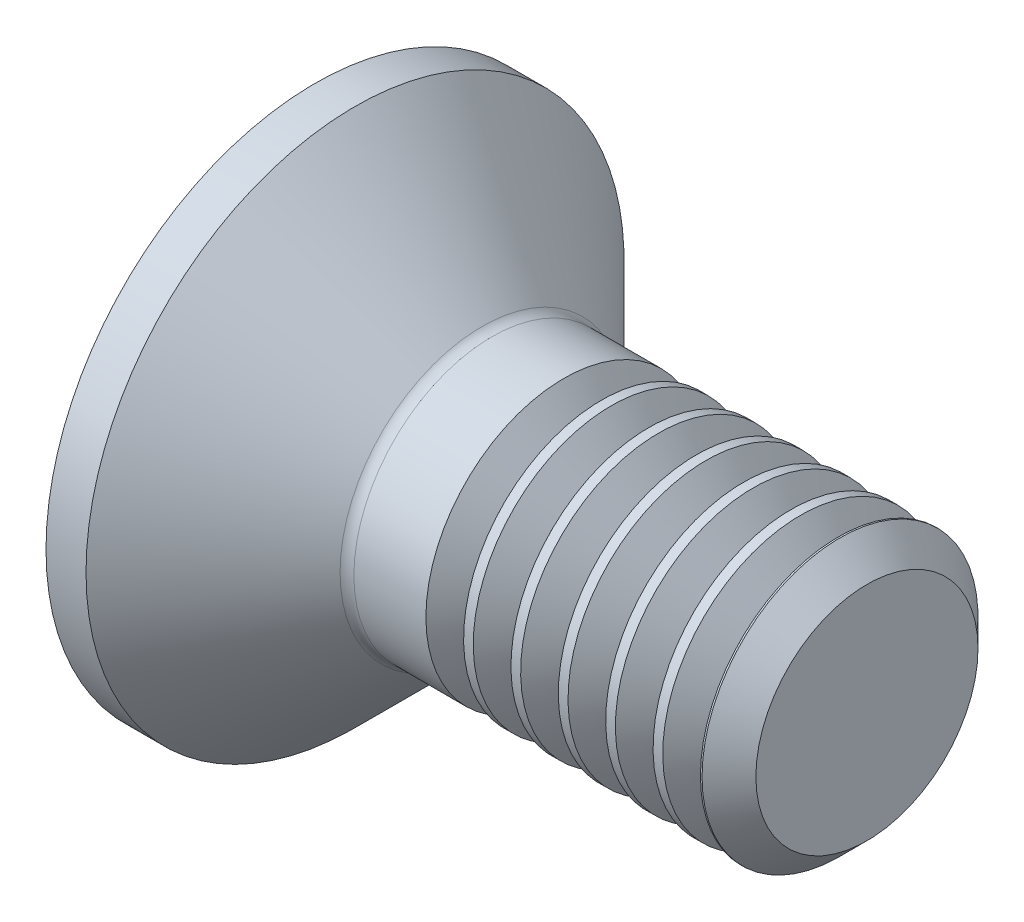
ISO-10303-21;
HEADER;
FILE_DESCRIPTION(('STEP AP214'),'2;1');
FILE_NAME('part.step','',(''),(''),'','','');
FILE_SCHEMA(('AUTOMOTIVE_DESIGN { 1 0 10303 214 1 1 1 1 }'));
ENDSEC;
DATA;
#1=APPLICATION_CONTEXT('core data for automotive mechanical design processes');
#2=APPLICATION_PROTOCOL_DEFINITION('international standard','automotive_design',2000,#1);
#3=PRODUCT_CONTEXT('',#1,'mechanical');
#4=PRODUCT('Part','Part','',(#3));
#5=PRODUCT_RELATED_PRODUCT_CATEGORY('part','',(#4));
#6=PRODUCT_DEFINITION_FORMATION('','',#4);
#7=PRODUCT_DEFINITION_CONTEXT('part definition',#1,'design');
#8=PRODUCT_DEFINITION('design','',#6,#7);
#9=PRODUCT_DEFINITION_SHAPE('','',#8);
#10=(LENGTH_UNIT() NAMED_UNIT(*) SI_UNIT(.MILLI.,.METRE.));
#11=(NAMED_UNIT(*) PLANE_ANGLE_UNIT() SI_UNIT($,.RADIAN.));
#12=(NAMED_UNIT(*) SI_UNIT($,.STERADIAN.) SOLID_ANGLE_UNIT());
#13=UNCERTAINTY_MEASURE_WITH_UNIT(LENGTH_MEASURE(1.E-05),#10,'distance_accuracy_value','');
#14=(GEOMETRIC_REPRESENTATION_CONTEXT(3) GLOBAL_UNCERTAINTY_ASSIGNED_CONTEXT((#13)) GLOBAL_UNIT_ASSIGNED_CONTEXT((#10,
#11,#12)) REPRESENTATION_CONTEXT('',''));
#15=CARTESIAN_POINT('',(0.,0.,0.));
#16=DIRECTION('',(0.,0.,1.));
#17=DIRECTION('',(1.,0.,0.));
#18=AXIS2_PLACEMENT_3D('',#15,#16,#17);
#19=CARTESIAN_POINT('',(0.,0.,0.));
#20=DIRECTION('',(-1.,0.,0.));
#21=DIRECTION('',(0.,0.,1.));
#22=AXIS2_PLACEMENT_3D('',#19,#20,#21);
#23=PLANE('',#22);
#24=CARTESIAN_POINT('',(0.,0.,0.));
#25=DIRECTION('',(-1.,0.,0.));
#26=DIRECTION('',(0.,0.,1.));
#27=AXIS2_PLACEMENT_3D('',#24,#25,#26);
#28=CIRCLE('',#27,3.9);
#29=CARTESIAN_POINT('',(0.,0.,3.9));
#30=VERTEX_POINT('',#29);
#31=EDGE_CURVE('E158',#30,#30,#28,.T.);
#32=ORIENTED_EDGE('',*,*,#31,.T.);
#33=EDGE_LOOP('',(#32));
#34=FACE_BOUND('',#33,.T.);
#35=DIRECTION('',(0.,-0.5,-0.866025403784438));
#36=VECTOR('',#35,1.);
#37=CARTESIAN_POINT('',(0.,-0.721687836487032,1.25));
#38=LINE('',#37,#36);
#39=CARTESIAN_POINT('',(0.,-0.721687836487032,1.25));
#40=VERTEX_POINT('',#39);
#41=CARTESIAN_POINT('',(0.,-1.44337567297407,0.));
#42=VERTEX_POINT('',#41);
#43=EDGE_CURVE('E120',#40,#42,#38,.T.);
#44=ORIENTED_EDGE('',*,*,#43,.T.);
#45=DIRECTION('',(0.,0.5,-0.866025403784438));
#46=VECTOR('',#45,1.);
#47=CARTESIAN_POINT('',(0.,-1.44337567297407,0.));
#48=LINE('',#47,#46);
#49=CARTESIAN_POINT('',(0.,-0.721687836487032,-1.25));
#50=VERTEX_POINT('',#49);
#51=EDGE_CURVE('E50',#42,#50,#48,.T.);
#52=ORIENTED_EDGE('',*,*,#51,.T.);
#53=DIRECTION('',(0.,1.,0.));
#54=VECTOR('',#53,1.);
#55=CARTESIAN_POINT('',(0.,-0.721687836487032,-1.25));
#56=LINE('',#55,#54);
#57=CARTESIAN_POINT('',(0.,0.721687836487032,-1.25));
#58=VERTEX_POINT('',#57);
#59=EDGE_CURVE('E135',#50,#58,#56,.T.);
#60=ORIENTED_EDGE('',*,*,#59,.T.);
#61=DIRECTION('',(0.,0.5,0.866025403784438));
#62=VECTOR('',#61,1.);
#63=CARTESIAN_POINT('',(0.,0.721687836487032,-1.25));
#64=LINE('',#63,#62);
#65=CARTESIAN_POINT('',(0.,1.44337567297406,0.));
#66=VERTEX_POINT('',#65);
#67=EDGE_CURVE('E353',#58,#66,#64,.T.);
#68=ORIENTED_EDGE('',*,*,#67,.T.);
#69=DIRECTION('',(0.,-0.5,0.866025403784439));
#70=VECTOR('',#69,1.);
#71=CARTESIAN_POINT('',(0.,1.44337567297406,0.));
#72=LINE('',#71,#70);
#73=CARTESIAN_POINT('',(0.,0.721687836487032,1.25));
#74=VERTEX_POINT('',#73);
#75=EDGE_CURVE('E356',#66,#74,#72,.T.);
#76=ORIENTED_EDGE('',*,*,#75,.T.);
#77=DIRECTION('',(0.,-1.,0.));
#78=VECTOR('',#77,1.);
#79=CARTESIAN_POINT('',(0.,0.721687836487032,1.25));
#80=LINE('',#79,#78);
#81=EDGE_CURVE('E359',#74,#40,#80,.T.);
#82=ORIENTED_EDGE('',*,*,#81,.T.);
#83=EDGE_LOOP('',(#44,#52,#60,#68,#76,#82));
#84=FACE_BOUND('',#83,.T.);
#85=ADVANCED_FACE('F35',(#34,#84),#23,.T.);
#86=CARTESIAN_POINT('',(0.,0.,0.));
#87=DIRECTION('',(-1.,0.,0.));
#88=DIRECTION('',(0.,0.,1.));
#89=AXIS2_PLACEMENT_3D('',#86,#87,#88);
#90=CYLINDRICAL_SURFACE('',#89,3.9);
#91=CARTESIAN_POINT('',(0.580000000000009,0.,0.));
#92=DIRECTION('',(-1.,0.,0.));
#93=DIRECTION('',(0.,0.,1.));
#94=AXIS2_PLACEMENT_3D('',#91,#92,#93);
#95=CIRCLE('',#94,3.9);
#96=CARTESIAN_POINT('',(0.580000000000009,0.,3.9));
#97=VERTEX_POINT('',#96);
#98=EDGE_CURVE('E155',#97,#97,#95,.T.);
#99=ORIENTED_EDGE('',*,*,#98,.T.);
#100=EDGE_LOOP('',(#99));
#101=FACE_BOUND('',#100,.T.);
#102=ORIENTED_EDGE('',*,*,#31,.F.);
#103=EDGE_LOOP('',(#102));
#104=FACE_BOUND('',#103,.T.);
#105=ADVANCED_FACE('F180',(#101,#104),#90,.T.);
#106=CARTESIAN_POINT('',(0.580000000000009,0.,0.));
#107=DIRECTION('',(-1.,0.,0.));
#108=DIRECTION('',(0.,0.,1.));
#109=AXIS2_PLACEMENT_3D('',#106,#107,#108);
#110=CONICAL_SURFACE('',#109,3.9,0.78539816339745);
#111=CARTESIAN_POINT('',(2.42142135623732,0.,0.));
#112=DIRECTION('',(-1.,0.,0.));
#113=DIRECTION('',(0.,0.,1.));
#114=AXIS2_PLACEMENT_3D('',#111,#112,#113);
#115=CIRCLE('',#114,2.05857864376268);
#116=CARTESIAN_POINT('',(2.42142135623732,0.,2.05857864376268));
#117=VERTEX_POINT('',#116);
#118=EDGE_CURVE('E43',#117,#117,#115,.T.);
#119=ORIENTED_EDGE('',*,*,#118,.T.);
#120=EDGE_LOOP('',(#119));
#121=FACE_BOUND('',#120,.T.);
#122=ORIENTED_EDGE('',*,*,#98,.F.);
#123=EDGE_LOOP('',(#122));
#124=FACE_BOUND('',#123,.T.);
#125=ADVANCED_FACE('F163',(#121,#124),#110,.T.);
#126=CARTESIAN_POINT('',(0.,0.,0.));
#127=DIRECTION('',(-1.,0.,0.));
#128=DIRECTION('',(0.,0.,1.));
#129=AXIS2_PLACEMENT_3D('',#126,#127,#128);
#130=CYLINDRICAL_SURFACE('',#129,1.99999999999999);
#131=CARTESIAN_POINT('',(3.60692006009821,0.,0.));
#132=DIRECTION('',(-1.,0.,0.));
#133=DIRECTION('',(0.,-1.,0.));
#134=AXIS2_PLACEMENT_3D('',#131,#132,#133);
#135=CIRCLE('',#134,2.);
#136=CARTESIAN_POINT('',(3.60692006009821,-2.,0.));
#137=VERTEX_POINT('',#136);
#138=EDGE_CURVE('E331',#137,#137,#135,.T.);
#139=ORIENTED_EDGE('',*,*,#138,.T.);
#140=EDGE_LOOP('',(#139));
#141=FACE_BOUND('',#140,.T.);
#142=CARTESIAN_POINT('',(2.56284271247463,0.,0.));
#143=DIRECTION('',(-1.,0.,0.));
#144=DIRECTION('',(0.,0.,1.));
#145=AXIS2_PLACEMENT_3D('',#142,#143,#144);
#146=CIRCLE('',#145,1.99999999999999);
#147=CARTESIAN_POINT('',(2.56284271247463,0.,1.99999999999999));
#148=VERTEX_POINT('',#147);
#149=EDGE_CURVE('E11',#148,#148,#146,.F.);
#150=ORIENTED_EDGE('',*,*,#149,.T.);
#151=EDGE_LOOP('',(#150));
#152=FACE_BOUND('',#151,.T.);
#153=ADVANCED_FACE('F167',(#141,#152),#130,.T.);
#154=CARTESIAN_POINT('',(2.56284271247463,0.,0.));
#155=DIRECTION('',(-1.,0.,0.));
#156=DIRECTION('',(0.,0.,1.));
#157=AXIS2_PLACEMENT_3D('',#154,#155,#156);
#158=TOROIDAL_SURFACE('',#157,2.19999999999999,0.2);
#159=ORIENTED_EDGE('',*,*,#149,.F.);
#160=EDGE_LOOP('',(#159));
#161=FACE_BOUND('',#160,.T.);
#162=ORIENTED_EDGE('',*,*,#118,.F.);
#163=EDGE_LOOP('',(#162));
#164=FACE_BOUND('',#163,.T.);
#165=ADVANCED_FACE('F37',(#161,#164),#158,.F.);
#166=CARTESIAN_POINT('',(1.5,-1.44337567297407,0.));
#167=DIRECTION('',(0.,0.866025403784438,0.5));
#168=DIRECTION('',(0.,-0.5,0.866025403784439));
#169=AXIS2_PLACEMENT_3D('',#166,#167,#168);
#170=PLANE('',#169);
#171=ORIENTED_EDGE('',*,*,#51,.F.);
#172=DIRECTION('',(-1.,0.,0.));
#173=VECTOR('',#172,1.);
#174=CARTESIAN_POINT('',(1.5,-1.44337567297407,0.));
#175=LINE('',#174,#173);
#176=CARTESIAN_POINT('',(1.5,-1.44337567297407,0.));
#177=VERTEX_POINT('',#176);
#178=EDGE_CURVE('E350',#177,#42,#175,.T.);
#179=ORIENTED_EDGE('',*,*,#178,.F.);
#180=DIRECTION('',(0.,0.5,-0.866025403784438));
#181=VECTOR('',#180,1.);
#182=CARTESIAN_POINT('',(1.5,-1.44337567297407,0.));
#183=LINE('',#182,#181);
#184=CARTESIAN_POINT('',(1.5,-1.08253175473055,-0.625000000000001));
#185=VERTEX_POINT('',#184);
#186=EDGE_CURVE('E117',#177,#185,#183,.T.);
#187=ORIENTED_EDGE('',*,*,#186,.T.);
#188=CARTESIAN_POINT('',(1.5,-0.721687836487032,-1.25));
#189=VERTEX_POINT('',#188);
#190=EDGE_CURVE('E111',#185,#189,#183,.T.);
#191=ORIENTED_EDGE('',*,*,#190,.T.);
#192=DIRECTION('',(-1.,0.,0.));
#193=VECTOR('',#192,1.);
#194=CARTESIAN_POINT('',(1.5,-0.721687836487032,-1.25));
#195=LINE('',#194,#193);
#196=EDGE_CURVE('E115',#189,#50,#195,.T.);
#197=ORIENTED_EDGE('',*,*,#196,.T.);
#198=EDGE_LOOP('',(#171,#179,#187,#191,#197));
#199=FACE_BOUND('',#198,.T.);
#200=ADVANCED_FACE('F113',(#199),#170,.T.);
#201=CARTESIAN_POINT('',(1.5,-0.721687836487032,-1.25));
#202=DIRECTION('',(0.,0.,1.));
#203=DIRECTION('',(0.,-1.,0.));
#204=AXIS2_PLACEMENT_3D('',#201,#202,#203);
#205=PLANE('',#204);
#206=ORIENTED_EDGE('',*,*,#59,.F.);
#207=ORIENTED_EDGE('',*,*,#196,.F.);
#208=DIRECTION('',(0.,1.,0.));
#209=VECTOR('',#208,1.);
#210=CARTESIAN_POINT('',(1.5,-0.721687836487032,-1.25));
#211=LINE('',#210,#209);
#212=CARTESIAN_POINT('',(1.5,0.,-1.25));
#213=VERTEX_POINT('',#212);
#214=EDGE_CURVE('E123',#189,#213,#211,.T.);
#215=ORIENTED_EDGE('',*,*,#214,.T.);
#216=CARTESIAN_POINT('',(1.5,0.721687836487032,-1.25));
#217=VERTEX_POINT('',#216);
#218=EDGE_CURVE('E130',#213,#217,#211,.T.);
#219=ORIENTED_EDGE('',*,*,#218,.T.);
#220=DIRECTION('',(-1.,0.,0.));
#221=VECTOR('',#220,1.);
#222=CARTESIAN_POINT('',(1.5,0.721687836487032,-1.25));
#223=LINE('',#222,#221);
#224=EDGE_CURVE('E137',#217,#58,#223,.T.);
#225=ORIENTED_EDGE('',*,*,#224,.T.);
#226=EDGE_LOOP('',(#206,#207,#215,#219,#225));
#227=FACE_BOUND('',#226,.T.);
#228=ADVANCED_FACE('F132',(#227),#205,.T.);
#229=CARTESIAN_POINT('',(1.5,0.721687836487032,-1.25));
#230=DIRECTION('',(0.,-0.866025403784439,0.5));
#231=DIRECTION('',(0.,-0.5,-0.866025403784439));
#232=AXIS2_PLACEMENT_3D('',#229,#230,#231);
#233=PLANE('',#232);
#234=ORIENTED_EDGE('',*,*,#67,.F.);
#235=ORIENTED_EDGE('',*,*,#224,.F.);
#236=DIRECTION('',(0.,0.5,0.866025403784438));
#237=VECTOR('',#236,1.);
#238=CARTESIAN_POINT('',(1.5,0.721687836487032,-1.25));
#239=LINE('',#238,#237);
#240=CARTESIAN_POINT('',(1.5,1.08253175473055,-0.625));
#241=VERTEX_POINT('',#240);
#242=EDGE_CURVE('E337',#217,#241,#239,.T.);
#243=ORIENTED_EDGE('',*,*,#242,.T.);
#244=CARTESIAN_POINT('',(1.5,1.44337567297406,0.));
#245=VERTEX_POINT('',#244);
#246=EDGE_CURVE('E129',#241,#245,#239,.T.);
#247=ORIENTED_EDGE('',*,*,#246,.T.);
#248=DIRECTION('',(-1.,0.,0.));
#249=VECTOR('',#248,1.);
#250=CARTESIAN_POINT('',(1.5,1.44337567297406,0.));
#251=LINE('',#250,#249);
#252=EDGE_CURVE('E143',#245,#66,#251,.T.);
#253=ORIENTED_EDGE('',*,*,#252,.T.);
#254=EDGE_LOOP('',(#234,#235,#243,#247,#253));
#255=FACE_BOUND('',#254,.T.);
#256=ADVANCED_FACE('F208',(#255),#233,.T.);
#257=CARTESIAN_POINT('',(1.5,1.44337567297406,0.));
#258=DIRECTION('',(0.,-0.866025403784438,-0.5));
#259=DIRECTION('',(0.,0.5,-0.866025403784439));
#260=AXIS2_PLACEMENT_3D('',#257,#258,#259);
#261=PLANE('',#260);
#262=ORIENTED_EDGE('',*,*,#75,.F.);
#263=ORIENTED_EDGE('',*,*,#252,.F.);
#264=DIRECTION('',(0.,-0.5,0.866025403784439));
#265=VECTOR('',#264,1.);
#266=CARTESIAN_POINT('',(1.5,1.44337567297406,0.));
#267=LINE('',#266,#265);
#268=CARTESIAN_POINT('',(1.5,1.08253175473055,0.625));
#269=VERTEX_POINT('',#268);
#270=EDGE_CURVE('E58',#245,#269,#267,.T.);
#271=ORIENTED_EDGE('',*,*,#270,.T.);
#272=CARTESIAN_POINT('',(1.5,0.721687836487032,1.25));
#273=VERTEX_POINT('',#272);
#274=EDGE_CURVE('E340',#269,#273,#267,.T.);
#275=ORIENTED_EDGE('',*,*,#274,.T.);
#276=DIRECTION('',(-1.,0.,0.));
#277=VECTOR('',#276,1.);
#278=CARTESIAN_POINT('',(1.5,0.721687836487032,1.25));
#279=LINE('',#278,#277);
#280=EDGE_CURVE('E368',#273,#74,#279,.T.);
#281=ORIENTED_EDGE('',*,*,#280,.T.);
#282=EDGE_LOOP('',(#262,#263,#271,#275,#281));
#283=FACE_BOUND('',#282,.T.);
#284=ADVANCED_FACE('F211',(#283),#261,.T.);
#285=CARTESIAN_POINT('',(1.5,0.721687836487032,1.25));
#286=DIRECTION('',(0.,0.,-1.));
#287=DIRECTION('',(-1.,0.,0.));
#288=AXIS2_PLACEMENT_3D('',#285,#286,#287);
#289=PLANE('',#288);
#290=ORIENTED_EDGE('',*,*,#81,.F.);
#291=ORIENTED_EDGE('',*,*,#280,.F.);
#292=DIRECTION('',(0.,-1.,0.));
#293=VECTOR('',#292,1.);
#294=CARTESIAN_POINT('',(1.5,0.721687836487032,1.25));
#295=LINE('',#294,#293);
#296=CARTESIAN_POINT('',(1.5,0.,1.25));
#297=VERTEX_POINT('',#296);
#298=EDGE_CURVE('E343',#273,#297,#295,.T.);
#299=ORIENTED_EDGE('',*,*,#298,.T.);
#300=CARTESIAN_POINT('',(1.5,-0.721687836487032,1.25));
#301=VERTEX_POINT('',#300);
#302=EDGE_CURVE('E342',#297,#301,#295,.T.);
#303=ORIENTED_EDGE('',*,*,#302,.T.);
#304=DIRECTION('',(-1.,0.,0.));
#305=VECTOR('',#304,1.);
#306=CARTESIAN_POINT('',(1.5,-0.721687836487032,1.25));
#307=LINE('',#306,#305);
#308=EDGE_CURVE('E365',#301,#40,#307,.T.);
#309=ORIENTED_EDGE('',*,*,#308,.T.);
#310=EDGE_LOOP('',(#290,#291,#299,#303,#309));
#311=FACE_BOUND('',#310,.T.);
#312=ADVANCED_FACE('F215',(#311),#289,.T.);
#313=CARTESIAN_POINT('',(1.5,-0.721687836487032,1.25));
#314=DIRECTION('',(0.,0.866025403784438,-0.5));
#315=DIRECTION('',(0.,0.5,0.866025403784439));
#316=AXIS2_PLACEMENT_3D('',#313,#314,#315);
#317=PLANE('',#316);
#318=ORIENTED_EDGE('',*,*,#43,.F.);
#319=ORIENTED_EDGE('',*,*,#308,.F.);
#320=DIRECTION('',(0.,-0.5,-0.866025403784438));
#321=VECTOR('',#320,1.);
#322=CARTESIAN_POINT('',(1.5,-0.721687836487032,1.25));
#323=LINE('',#322,#321);
#324=CARTESIAN_POINT('',(1.5,-1.08253175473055,0.625000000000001));
#325=VERTEX_POINT('',#324);
#326=EDGE_CURVE('E347',#301,#325,#323,.T.);
#327=ORIENTED_EDGE('',*,*,#326,.T.);
#328=EDGE_CURVE('E346',#325,#177,#323,.T.);
#329=ORIENTED_EDGE('',*,*,#328,.T.);
#330=ORIENTED_EDGE('',*,*,#178,.T.);
#331=EDGE_LOOP('',(#318,#319,#327,#329,#330));
#332=FACE_BOUND('',#331,.T.);
#333=ADVANCED_FACE('F218',(#332),#317,.T.);
#334=CARTESIAN_POINT('',(1.5,-1.44337567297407,0.));
#335=DIRECTION('',(-1.,0.,0.));
#336=DIRECTION('',(0.,0.,1.));
#337=AXIS2_PLACEMENT_3D('',#334,#335,#336);
#338=PLANE('',#337);
#339=CARTESIAN_POINT('',(1.5,0.,0.));
#340=DIRECTION('',(-1.,0.,0.));
#341=DIRECTION('',(0.,0.,1.));
#342=AXIS2_PLACEMENT_3D('',#339,#340,#341);
#343=CIRCLE('',#342,1.25);
#344=EDGE_CURVE('E136',#325,#297,#343,.T.);
#345=ORIENTED_EDGE('',*,*,#344,.F.);
#346=ORIENTED_EDGE('',*,*,#326,.F.);
#347=ORIENTED_EDGE('',*,*,#302,.F.);
#348=EDGE_LOOP('',(#345,#346,#347));
#349=FACE_BOUND('',#348,.T.);
#350=ADVANCED_FACE('F222',(#349),#338,.T.);
#351=EDGE_CURVE('E140',#185,#325,#343,.T.);
#352=ORIENTED_EDGE('',*,*,#351,.F.);
#353=ORIENTED_EDGE('',*,*,#186,.F.);
#354=ORIENTED_EDGE('',*,*,#328,.F.);
#355=EDGE_LOOP('',(#352,#353,#354));
#356=FACE_BOUND('',#355,.T.);
#357=ADVANCED_FACE('F226',(#356),#338,.T.);
#358=EDGE_CURVE('E125',#213,#185,#343,.T.);
#359=ORIENTED_EDGE('',*,*,#358,.F.);
#360=ORIENTED_EDGE('',*,*,#214,.F.);
#361=ORIENTED_EDGE('',*,*,#190,.F.);
#362=EDGE_LOOP('',(#359,#360,#361));
#363=FACE_BOUND('',#362,.T.);
#364=ADVANCED_FACE('F124',(#363),#338,.T.);
#365=EDGE_CURVE('E382',#241,#213,#343,.T.);
#366=ORIENTED_EDGE('',*,*,#365,.F.);
#367=ORIENTED_EDGE('',*,*,#242,.F.);
#368=ORIENTED_EDGE('',*,*,#218,.F.);
#369=EDGE_LOOP('',(#366,#367,#368));
#370=FACE_BOUND('',#369,.T.);
#371=ADVANCED_FACE('F389',(#370),#338,.T.);
#372=EDGE_CURVE('E149',#269,#241,#343,.T.);
#373=ORIENTED_EDGE('',*,*,#372,.F.);
#374=ORIENTED_EDGE('',*,*,#270,.F.);
#375=ORIENTED_EDGE('',*,*,#246,.F.);
#376=EDGE_LOOP('',(#373,#374,#375));
#377=FACE_BOUND('',#376,.T.);
#378=ADVANCED_FACE('F386',(#377),#338,.T.);
#379=EDGE_CURVE('E142',#297,#269,#343,.T.);
#380=ORIENTED_EDGE('',*,*,#379,.F.);
#381=ORIENTED_EDGE('',*,*,#298,.F.);
#382=ORIENTED_EDGE('',*,*,#274,.F.);
#383=EDGE_LOOP('',(#380,#381,#382));
#384=FACE_BOUND('',#383,.T.);
#385=ADVANCED_FACE('F203',(#384),#338,.T.);
#386=CARTESIAN_POINT('',(1.5,0.,0.));
#387=DIRECTION('',(-1.,0.,0.));
#388=DIRECTION('',(0.,0.,1.));
#389=AXIS2_PLACEMENT_3D('',#386,#387,#388);
#390=CONICAL_SURFACE('',#389,1.25,1.04719755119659);
#391=CARTESIAN_POINT('',(2.22168783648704,0.,0.));
#392=VERTEX_POINT('',#391);
#393=VERTEX_LOOP('',#392);
#394=FACE_BOUND('',#393,.T.);
#395=ORIENTED_EDGE('',*,*,#379,.T.);
#396=ORIENTED_EDGE('',*,*,#372,.T.);
#397=ORIENTED_EDGE('',*,*,#365,.T.);
#398=ORIENTED_EDGE('',*,*,#358,.T.);
#399=ORIENTED_EDGE('',*,*,#351,.T.);
#400=ORIENTED_EDGE('',*,*,#344,.T.);
#401=EDGE_LOOP('',(#395,#396,#397,#398,#399,#400));
#402=FACE_BOUND('',#401,.T.);
#403=ADVANCED_FACE('F200',(#394,#402),#390,.F.);
#404=CARTESIAN_POINT('',(4.15308193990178,0.,0.));
#405=DIRECTION('',(1.,0.,0.));
#406=DIRECTION('',(0.,1.,0.));
#407=AXIS2_PLACEMENT_3D('',#404,#405,#406);
#408=CONICAL_SURFACE('',#407,2.,0.959931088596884);
#409=CARTESIAN_POINT('',(3.880001,0.,0.));
#410=DIRECTION('',(-1.,0.,0.));
#411=DIRECTION('',(0.,-1.,0.));
#412=AXIS2_PLACEMENT_3D('',#409,#410,#411);
#413=CIRCLE('',#412,1.61);
#414=CARTESIAN_POINT('',(3.880001,-1.61,0.));
#415=VERTEX_POINT('',#414);
#416=EDGE_CURVE('E328',#415,#415,#413,.T.);
#417=ORIENTED_EDGE('',*,*,#416,.F.);
#418=EDGE_LOOP('',(#417));
#419=FACE_BOUND('',#418,.T.);
#420=CARTESIAN_POINT('',(4.15308193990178,0.,0.));
#421=DIRECTION('',(-1.,0.,0.));
#422=DIRECTION('',(0.,-1.,0.));
#423=AXIS2_PLACEMENT_3D('',#420,#421,#422);
#424=CIRCLE('',#423,2.);
#425=CARTESIAN_POINT('',(4.15308193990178,-2.,0.));
#426=VERTEX_POINT('',#425);
#427=EDGE_CURVE('E334',#426,#426,#424,.T.);
#428=ORIENTED_EDGE('',*,*,#427,.T.);
#429=EDGE_LOOP('',(#428));
#430=FACE_BOUND('',#429,.T.);
#431=ADVANCED_FACE('F202',(#419,#430),#408,.T.);
#432=CARTESIAN_POINT('',(3.880001,0.,0.));
#433=DIRECTION('',(-1.,0.,0.));
#434=DIRECTION('',(0.,-1.,0.));
#435=AXIS2_PLACEMENT_3D('',#432,#433,#434);
#436=CONICAL_SURFACE('',#435,1.61,0.959931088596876);
#437=ORIENTED_EDGE('',*,*,#138,.F.);
#438=EDGE_LOOP('',(#437));
#439=FACE_BOUND('',#438,.T.);
#440=ORIENTED_EDGE('',*,*,#416,.T.);
#441=EDGE_LOOP('',(#440));
#442=FACE_BOUND('',#441,.T.);
#443=ADVANCED_FACE('F230',(#439,#442),#436,.T.);
#444=CARTESIAN_POINT('',(4.29358672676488,0.,0.));
#445=DIRECTION('',(-1.,0.,0.));
#446=DIRECTION('',(0.,-1.,0.));
#447=AXIS2_PLACEMENT_3D('',#444,#445,#446);
#448=CIRCLE('',#447,2.);
#449=CARTESIAN_POINT('',(4.29358672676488,-2.,0.));
#450=VERTEX_POINT('',#449);
#451=EDGE_CURVE('E322',#450,#450,#448,.T.);
#452=ORIENTED_EDGE('',*,*,#451,.T.);
#453=EDGE_LOOP('',(#452));
#454=FACE_BOUND('',#453,.T.);
#455=ORIENTED_EDGE('',*,*,#427,.F.);
#456=EDGE_LOOP('',(#455));
#457=FACE_BOUND('',#456,.T.);
#458=ADVANCED_FACE('F177',(#454,#457),#130,.T.);
#459=CARTESIAN_POINT('',(4.83974860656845,0.,0.));
#460=DIRECTION('',(1.,0.,0.));
#461=DIRECTION('',(0.,1.,0.));
#462=AXIS2_PLACEMENT_3D('',#459,#460,#461);
#463=CONICAL_SURFACE('',#462,2.,0.959931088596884);
#464=CARTESIAN_POINT('',(4.56666766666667,0.,0.));
#465=DIRECTION('',(-1.,0.,0.));
#466=DIRECTION('',(0.,-1.,0.));
#467=AXIS2_PLACEMENT_3D('',#464,#465,#466);
#468=CIRCLE('',#467,1.61);
#469=CARTESIAN_POINT('',(4.56666766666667,-1.61,0.));
#470=VERTEX_POINT('',#469);
#471=EDGE_CURVE('E319',#470,#470,#468,.T.);
#472=ORIENTED_EDGE('',*,*,#471,.F.);
#473=EDGE_LOOP('',(#472));
#474=FACE_BOUND('',#473,.T.);
#475=CARTESIAN_POINT('',(4.83974860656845,0.,0.));
#476=DIRECTION('',(-1.,0.,0.));
#477=DIRECTION('',(0.,-1.,0.));
#478=AXIS2_PLACEMENT_3D('',#475,#476,#477);
#479=CIRCLE('',#478,2.);
#480=CARTESIAN_POINT('',(4.83974860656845,-2.,0.));
#481=VERTEX_POINT('',#480);
#482=EDGE_CURVE('E325',#481,#481,#479,.T.);
#483=ORIENTED_EDGE('',*,*,#482,.T.);
#484=EDGE_LOOP('',(#483));
#485=FACE_BOUND('',#484,.T.);
#486=ADVANCED_FACE('F235',(#474,#485),#463,.T.);
#487=CARTESIAN_POINT('',(4.56666766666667,0.,0.));
#488=DIRECTION('',(-1.,0.,0.));
#489=DIRECTION('',(0.,-1.,0.));
#490=AXIS2_PLACEMENT_3D('',#487,#488,#489);
#491=CONICAL_SURFACE('',#490,1.61,0.959931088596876);
#492=ORIENTED_EDGE('',*,*,#451,.F.);
#493=EDGE_LOOP('',(#492));
#494=FACE_BOUND('',#493,.T.);
#495=ORIENTED_EDGE('',*,*,#471,.T.);
#496=EDGE_LOOP('',(#495));
#497=FACE_BOUND('',#496,.T.);
#498=ADVANCED_FACE('F238',(#494,#497),#491,.T.);
#499=CARTESIAN_POINT('',(4.98025339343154,0.,0.));
#500=DIRECTION('',(-1.,0.,0.));
#501=DIRECTION('',(0.,-1.,0.));
#502=AXIS2_PLACEMENT_3D('',#499,#500,#501);
#503=CIRCLE('',#502,2.);
#504=CARTESIAN_POINT('',(4.98025339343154,-2.,0.));
#505=VERTEX_POINT('',#504);
#506=EDGE_CURVE('E313',#505,#505,#503,.T.);
#507=ORIENTED_EDGE('',*,*,#506,.T.);
#508=EDGE_LOOP('',(#507));
#509=FACE_BOUND('',#508,.T.);
#510=ORIENTED_EDGE('',*,*,#482,.F.);
#511=EDGE_LOOP('',(#510));
#512=FACE_BOUND('',#511,.T.);
#513=ADVANCED_FACE('F242',(#509,#512),#130,.T.);
#514=CARTESIAN_POINT('',(5.52641527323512,0.,0.));
#515=DIRECTION('',(1.,0.,0.));
#516=DIRECTION('',(0.,1.,0.));
#517=AXIS2_PLACEMENT_3D('',#514,#515,#516);
#518=CONICAL_SURFACE('',#517,2.,0.959931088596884);
#519=CARTESIAN_POINT('',(5.25333433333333,0.,0.));
#520=DIRECTION('',(-1.,0.,0.));
#521=DIRECTION('',(0.,-1.,0.));
#522=AXIS2_PLACEMENT_3D('',#519,#520,#521);
#523=CIRCLE('',#522,1.61);
#524=CARTESIAN_POINT('',(5.25333433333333,-1.61,0.));
#525=VERTEX_POINT('',#524);
#526=EDGE_CURVE('E310',#525,#525,#523,.T.);
#527=ORIENTED_EDGE('',*,*,#526,.F.);
#528=EDGE_LOOP('',(#527));
#529=FACE_BOUND('',#528,.T.);
#530=CARTESIAN_POINT('',(5.52641527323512,0.,0.));
#531=DIRECTION('',(-1.,0.,0.));
#532=DIRECTION('',(0.,-1.,0.));
#533=AXIS2_PLACEMENT_3D('',#530,#531,#532);
#534=CIRCLE('',#533,2.);
#535=CARTESIAN_POINT('',(5.52641527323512,-2.,0.));
#536=VERTEX_POINT('',#535);
#537=EDGE_CURVE('E316',#536,#536,#534,.T.);
#538=ORIENTED_EDGE('',*,*,#537,.T.);
#539=EDGE_LOOP('',(#538));
#540=FACE_BOUND('',#539,.T.);
#541=ADVANCED_FACE('F244',(#529,#540),#518,.T.);
#542=CARTESIAN_POINT('',(5.25333433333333,0.,0.));
#543=DIRECTION('',(-1.,0.,0.));
#544=DIRECTION('',(0.,-1.,0.));
#545=AXIS2_PLACEMENT_3D('',#542,#543,#544);
#546=CONICAL_SURFACE('',#545,1.61,0.959931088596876);
#547=ORIENTED_EDGE('',*,*,#506,.F.);
#548=EDGE_LOOP('',(#547));
#549=FACE_BOUND('',#548,.T.);
#550=ORIENTED_EDGE('',*,*,#526,.T.);
#551=EDGE_LOOP('',(#550));
#552=FACE_BOUND('',#551,.T.);
#553=ADVANCED_FACE('F247',(#549,#552),#546,.T.);
#554=CARTESIAN_POINT('',(5.66692006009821,0.,0.));
#555=DIRECTION('',(-1.,0.,0.));
#556=DIRECTION('',(0.,-1.,0.));
#557=AXIS2_PLACEMENT_3D('',#554,#555,#556);
#558=CIRCLE('',#557,2.);
#559=CARTESIAN_POINT('',(5.66692006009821,-2.,0.));
#560=VERTEX_POINT('',#559);
#561=EDGE_CURVE('E304',#560,#560,#558,.T.);
#562=ORIENTED_EDGE('',*,*,#561,.T.);
#563=EDGE_LOOP('',(#562));
#564=FACE_BOUND('',#563,.T.);
#565=ORIENTED_EDGE('',*,*,#537,.F.);
#566=EDGE_LOOP('',(#565));
#567=FACE_BOUND('',#566,.T.);
#568=ADVANCED_FACE('F251',(#564,#567),#130,.T.);
#569=CARTESIAN_POINT('',(6.21308193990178,0.,0.));
#570=DIRECTION('',(1.,0.,0.));
#571=DIRECTION('',(0.,1.,0.));
#572=AXIS2_PLACEMENT_3D('',#569,#570,#571);
#573=CONICAL_SURFACE('',#572,2.,0.959931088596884);
#574=CARTESIAN_POINT('',(5.940001,0.,0.));
#575=DIRECTION('',(-1.,0.,0.));
#576=DIRECTION('',(0.,-1.,0.));
#577=AXIS2_PLACEMENT_3D('',#574,#575,#576);
#578=CIRCLE('',#577,1.61);
#579=CARTESIAN_POINT('',(5.940001,-1.61,0.));
#580=VERTEX_POINT('',#579);
#581=EDGE_CURVE('E301',#580,#580,#578,.T.);
#582=ORIENTED_EDGE('',*,*,#581,.F.);
#583=EDGE_LOOP('',(#582));
#584=FACE_BOUND('',#583,.T.);
#585=CARTESIAN_POINT('',(6.21308193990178,0.,0.));
#586=DIRECTION('',(-1.,0.,0.));
#587=DIRECTION('',(0.,-1.,0.));
#588=AXIS2_PLACEMENT_3D('',#585,#586,#587);
#589=CIRCLE('',#588,2.);
#590=CARTESIAN_POINT('',(6.21308193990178,-2.,0.));
#591=VERTEX_POINT('',#590);
#592=EDGE_CURVE('E307',#591,#591,#589,.T.);
#593=ORIENTED_EDGE('',*,*,#592,.T.);
#594=EDGE_LOOP('',(#593));
#595=FACE_BOUND('',#594,.T.);
#596=ADVANCED_FACE('F253',(#584,#595),#573,.T.);
#597=CARTESIAN_POINT('',(5.940001,0.,0.));
#598=DIRECTION('',(-1.,0.,0.));
#599=DIRECTION('',(0.,-1.,0.));
#600=AXIS2_PLACEMENT_3D('',#597,#598,#599);
#601=CONICAL_SURFACE('',#600,1.61,0.959931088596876);
#602=ORIENTED_EDGE('',*,*,#561,.F.);
#603=EDGE_LOOP('',(#602));
#604=FACE_BOUND('',#603,.T.);
#605=ORIENTED_EDGE('',*,*,#581,.T.);
#606=EDGE_LOOP('',(#605));
#607=FACE_BOUND('',#606,.T.);
#608=ADVANCED_FACE('F256',(#604,#607),#601,.T.);
#609=CARTESIAN_POINT('',(6.35358672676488,0.,0.));
#610=DIRECTION('',(-1.,0.,0.));
#611=DIRECTION('',(0.,-1.,0.));
#612=AXIS2_PLACEMENT_3D('',#609,#610,#611);
#613=CIRCLE('',#612,2.);
#614=CARTESIAN_POINT('',(6.35358672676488,-2.,0.));
#615=VERTEX_POINT('',#614);
#616=EDGE_CURVE('E295',#615,#615,#613,.T.);
#617=ORIENTED_EDGE('',*,*,#616,.T.);
#618=EDGE_LOOP('',(#617));
#619=FACE_BOUND('',#618,.T.);
#620=ORIENTED_EDGE('',*,*,#592,.F.);
#621=EDGE_LOOP('',(#620));
#622=FACE_BOUND('',#621,.T.);
#623=ADVANCED_FACE('F260',(#619,#622),#130,.T.);
#624=CARTESIAN_POINT('',(6.89974860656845,0.,0.));
#625=DIRECTION('',(1.,0.,0.));
#626=DIRECTION('',(0.,1.,0.));
#627=AXIS2_PLACEMENT_3D('',#624,#625,#626);
#628=CONICAL_SURFACE('',#627,2.,0.959931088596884);
#629=CARTESIAN_POINT('',(6.62666766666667,0.,0.));
#630=DIRECTION('',(-1.,0.,0.));
#631=DIRECTION('',(0.,-1.,0.));
#632=AXIS2_PLACEMENT_3D('',#629,#630,#631);
#633=CIRCLE('',#632,1.61);
#634=CARTESIAN_POINT('',(6.62666766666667,-1.61,0.));
#635=VERTEX_POINT('',#634);
#636=EDGE_CURVE('E292',#635,#635,#633,.T.);
#637=ORIENTED_EDGE('',*,*,#636,.F.);
#638=EDGE_LOOP('',(#637));
#639=FACE_BOUND('',#638,.T.);
#640=CARTESIAN_POINT('',(6.89974860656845,0.,0.));
#641=DIRECTION('',(-1.,0.,0.));
#642=DIRECTION('',(0.,-1.,0.));
#643=AXIS2_PLACEMENT_3D('',#640,#641,#642);
#644=CIRCLE('',#643,2.);
#645=CARTESIAN_POINT('',(6.89974860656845,-2.,0.));
#646=VERTEX_POINT('',#645);
#647=EDGE_CURVE('E298',#646,#646,#644,.T.);
#648=ORIENTED_EDGE('',*,*,#647,.T.);
#649=EDGE_LOOP('',(#648));
#650=FACE_BOUND('',#649,.T.);
#651=ADVANCED_FACE('F262',(#639,#650),#628,.T.);
#652=CARTESIAN_POINT('',(6.62666766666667,0.,0.));
#653=DIRECTION('',(-1.,0.,0.));
#654=DIRECTION('',(0.,-1.,0.));
#655=AXIS2_PLACEMENT_3D('',#652,#653,#654);
#656=CONICAL_SURFACE('',#655,1.61,0.959931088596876);
#657=ORIENTED_EDGE('',*,*,#616,.F.);
#658=EDGE_LOOP('',(#657));
#659=FACE_BOUND('',#658,.T.);
#660=ORIENTED_EDGE('',*,*,#636,.T.);
#661=EDGE_LOOP('',(#660));
#662=FACE_BOUND('',#661,.T.);
#663=ADVANCED_FACE('F265',(#659,#662),#656,.T.);
#664=CARTESIAN_POINT('',(7.04025339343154,0.,0.));
#665=DIRECTION('',(-1.,0.,0.));
#666=DIRECTION('',(0.,-1.,0.));
#667=AXIS2_PLACEMENT_3D('',#664,#665,#666);
#668=CIRCLE('',#667,2.);
#669=CARTESIAN_POINT('',(7.04025339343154,-2.,0.));
#670=VERTEX_POINT('',#669);
#671=EDGE_CURVE('E282',#670,#670,#668,.T.);
#672=ORIENTED_EDGE('',*,*,#671,.T.);
#673=EDGE_LOOP('',(#672));
#674=FACE_BOUND('',#673,.T.);
#675=ORIENTED_EDGE('',*,*,#647,.F.);
#676=EDGE_LOOP('',(#675));
#677=FACE_BOUND('',#676,.T.);
#678=ADVANCED_FACE('F269',(#674,#677),#130,.T.);
#679=CARTESIAN_POINT('',(7.58641527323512,0.,0.));
#680=DIRECTION('',(1.,0.,0.));
#681=DIRECTION('',(0.,1.,0.));
#682=AXIS2_PLACEMENT_3D('',#679,#680,#681);
#683=CONICAL_SURFACE('',#682,2.,0.959931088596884);
#684=CARTESIAN_POINT('',(7.31333433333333,0.,0.));
#685=DIRECTION('',(-1.,0.,0.));
#686=DIRECTION('',(0.,-1.,0.));
#687=AXIS2_PLACEMENT_3D('',#684,#685,#686);
#688=CIRCLE('',#687,1.61);
#689=CARTESIAN_POINT('',(7.31333433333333,-1.61,0.));
#690=VERTEX_POINT('',#689);
#691=EDGE_CURVE('E285',#690,#690,#688,.T.);
#692=ORIENTED_EDGE('',*,*,#691,.F.);
#693=EDGE_LOOP('',(#692));
#694=FACE_BOUND('',#693,.T.);
#695=CARTESIAN_POINT('',(7.58641527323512,0.,0.));
#696=DIRECTION('',(-1.,0.,0.));
#697=DIRECTION('',(0.,-1.,0.));
#698=AXIS2_PLACEMENT_3D('',#695,#696,#697);
#699=CIRCLE('',#698,2.);
#700=CARTESIAN_POINT('',(7.58641527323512,-2.,0.));
#701=VERTEX_POINT('',#700);
#702=EDGE_CURVE('E287',#701,#701,#699,.T.);
#703=ORIENTED_EDGE('',*,*,#702,.T.);
#704=EDGE_LOOP('',(#703));
#705=FACE_BOUND('',#704,.T.);
#706=ADVANCED_FACE('F271',(#694,#705),#683,.T.);
#707=CARTESIAN_POINT('',(7.31333433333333,0.,0.));
#708=DIRECTION('',(-1.,0.,0.));
#709=DIRECTION('',(0.,-1.,0.));
#710=AXIS2_PLACEMENT_3D('',#707,#708,#709);
#711=CONICAL_SURFACE('',#710,1.61,0.959931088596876);
#712=ORIENTED_EDGE('',*,*,#671,.F.);
#713=EDGE_LOOP('',(#712));
#714=FACE_BOUND('',#713,.T.);
#715=ORIENTED_EDGE('',*,*,#691,.T.);
#716=EDGE_LOOP('',(#715));
#717=FACE_BOUND('',#716,.T.);
#718=ADVANCED_FACE('F198',(#714,#717),#711,.T.);
#719=CARTESIAN_POINT('',(8.,1.61,0.));
#720=DIRECTION('',(1.,0.,0.));
#721=DIRECTION('',(0.,0.,-1.));
#722=AXIS2_PLACEMENT_3D('',#719,#720,#721);
#723=PLANE('',#722);
#724=CARTESIAN_POINT('',(8.,0.,0.));
#725=DIRECTION('',(-1.,0.,0.));
#726=DIRECTION('',(0.,0.,1.));
#727=AXIS2_PLACEMENT_3D('',#724,#725,#726);
#728=CIRCLE('',#727,1.61);
#729=CARTESIAN_POINT('',(8.,0.,1.61));
#730=VERTEX_POINT('',#729);
#731=EDGE_CURVE('E148',#730,#730,#728,.T.);
#732=ORIENTED_EDGE('',*,*,#731,.F.);
#733=EDGE_LOOP('',(#732));
#734=FACE_BOUND('',#733,.T.);
#735=ADVANCED_FACE('F194',(#734),#723,.T.);
#736=CARTESIAN_POINT('',(8.,0.,0.));
#737=DIRECTION('',(-1.,0.,0.));
#738=DIRECTION('',(0.,0.,1.));
#739=AXIS2_PLACEMENT_3D('',#736,#737,#738);
#740=CONICAL_SURFACE('',#739,1.61,0.785398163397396);
#741=CARTESIAN_POINT('',(7.60999999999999,0.,0.));
#742=DIRECTION('',(-1.,0.,0.));
#743=DIRECTION('',(0.,0.,1.));
#744=AXIS2_PLACEMENT_3D('',#741,#742,#743);
#745=CIRCLE('',#744,1.99999999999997);
#746=CARTESIAN_POINT('',(7.60999999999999,0.,1.99999999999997));
#747=VERTEX_POINT('',#746);
#748=EDGE_CURVE('E152',#747,#747,#745,.T.);
#749=ORIENTED_EDGE('',*,*,#748,.F.);
#750=EDGE_LOOP('',(#749));
#751=FACE_BOUND('',#750,.T.);
#752=ORIENTED_EDGE('',*,*,#731,.T.);
#753=EDGE_LOOP('',(#752));
#754=FACE_BOUND('',#753,.T.);
#755=ADVANCED_FACE('F191',(#751,#754),#740,.T.);
#756=ORIENTED_EDGE('',*,*,#702,.F.);
#757=EDGE_LOOP('',(#756));
#758=FACE_BOUND('',#757,.T.);
#759=ORIENTED_EDGE('',*,*,#748,.T.);
#760=EDGE_LOOP('',(#759));
#761=FACE_BOUND('',#760,.T.);
#762=ADVANCED_FACE('F176',(#758,#761),#130,.T.);
#763=CLOSED_SHELL('',(#85,#105,#125,#153,#165,#200,#228,#256,#284,#312,#333,#350,#357,#364,#371,
#378,#385,#403,#431,#443,#458,#486,#498,#513,#541,#553,#568,#596,#608,#623,#651,#663,#678,#706,
#718,#735,#755,#762));
#764=MANIFOLD_SOLID_BREP('B2',#763);
#765=ADVANCED_BREP_SHAPE_REPRESENTATION('',(#18,#764),#14);
#766=SHAPE_DEFINITION_REPRESENTATION(#9,#765);
ENDSEC;
END-ISO-10303-21;
